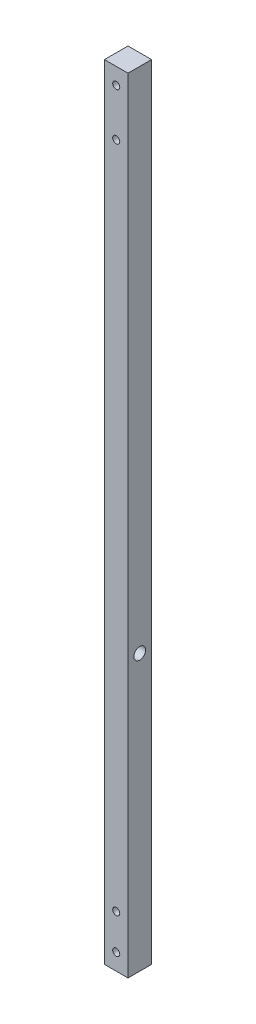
ISO-10303-21;
HEADER;
FILE_DESCRIPTION(('STEP AP214'),'2;1');
FILE_NAME('part.step','',(''),(''),'','','');
FILE_SCHEMA(('AUTOMOTIVE_DESIGN { 1 0 10303 214 1 1 1 1 }'));
ENDSEC;
DATA;
#1=APPLICATION_CONTEXT('core data for automotive mechanical design processes');
#2=APPLICATION_PROTOCOL_DEFINITION('international standard','automotive_design',2000,#1);
#3=PRODUCT_CONTEXT('',#1,'mechanical');
#4=PRODUCT('Part','Part','',(#3));
#5=PRODUCT_RELATED_PRODUCT_CATEGORY('part','',(#4));
#6=PRODUCT_DEFINITION_FORMATION('','',#4);
#7=PRODUCT_DEFINITION_CONTEXT('part definition',#1,'design');
#8=PRODUCT_DEFINITION('design','',#6,#7);
#9=PRODUCT_DEFINITION_SHAPE('','',#8);
#10=(LENGTH_UNIT() NAMED_UNIT(*) SI_UNIT(.MILLI.,.METRE.));
#11=(NAMED_UNIT(*) PLANE_ANGLE_UNIT() SI_UNIT($,.RADIAN.));
#12=(NAMED_UNIT(*) SI_UNIT($,.STERADIAN.) SOLID_ANGLE_UNIT());
#13=UNCERTAINTY_MEASURE_WITH_UNIT(LENGTH_MEASURE(1.E-05),#10,'distance_accuracy_value','');
#14=(GEOMETRIC_REPRESENTATION_CONTEXT(3) GLOBAL_UNCERTAINTY_ASSIGNED_CONTEXT((#13)) GLOBAL_UNIT_ASSIGNED_CONTEXT((#10,
#11,#12)) REPRESENTATION_CONTEXT('',''));
#15=CARTESIAN_POINT('',(0.,0.,0.));
#16=DIRECTION('',(0.,0.,1.));
#17=DIRECTION('',(1.,0.,0.));
#18=AXIS2_PLACEMENT_3D('',#15,#16,#17);
#19=CARTESIAN_POINT('',(0.,333.,0.));
#20=DIRECTION('',(1.,0.,0.));
#21=DIRECTION('',(0.,0.,-1.));
#22=AXIS2_PLACEMENT_3D('',#19,#20,#21);
#23=PLANE('',#22);
#24=CARTESIAN_POINT('',(0.,117.,-5.));
#25=DIRECTION('',(1.,0.,0.));
#26=DIRECTION('',(0.,0.,-1.));
#27=AXIS2_PLACEMENT_3D('',#24,#25,#26);
#28=CIRCLE('',#27,2.5);
#29=CARTESIAN_POINT('',(0.,117.,-7.5));
#30=VERTEX_POINT('',#29);
#31=EDGE_CURVE('E128',#30,#30,#28,.T.);
#32=ORIENTED_EDGE('',*,*,#31,.T.);
#33=EDGE_LOOP('',(#32));
#34=FACE_BOUND('',#33,.T.);
#35=DIRECTION('',(0.,0.,1.));
#36=VECTOR('',#35,1.);
#37=CARTESIAN_POINT('',(0.,0.,0.));
#38=LINE('',#37,#36);
#39=CARTESIAN_POINT('',(0.,0.,-10.));
#40=VERTEX_POINT('',#39);
#41=CARTESIAN_POINT('',(0.,0.,0.));
#42=VERTEX_POINT('',#41);
#43=EDGE_CURVE('E74',#40,#42,#38,.T.);
#44=ORIENTED_EDGE('',*,*,#43,.T.);
#45=DIRECTION('',(0.,-1.,0.));
#46=VECTOR('',#45,1.);
#47=CARTESIAN_POINT('',(0.,333.,0.));
#48=LINE('',#47,#46);
#49=CARTESIAN_POINT('',(0.,333.,0.));
#50=VERTEX_POINT('',#49);
#51=EDGE_CURVE('E11',#50,#42,#48,.T.);
#52=ORIENTED_EDGE('',*,*,#51,.F.);
#53=DIRECTION('',(0.,0.,1.));
#54=VECTOR('',#53,1.);
#55=CARTESIAN_POINT('',(0.,333.,0.));
#56=LINE('',#55,#54);
#57=CARTESIAN_POINT('',(0.,333.,-10.));
#58=VERTEX_POINT('',#57);
#59=EDGE_CURVE('E97',#58,#50,#56,.T.);
#60=ORIENTED_EDGE('',*,*,#59,.F.);
#61=DIRECTION('',(0.,-1.,0.));
#62=VECTOR('',#61,1.);
#63=CARTESIAN_POINT('',(0.,333.,-10.));
#64=LINE('',#63,#62);
#65=EDGE_CURVE('E86',#58,#40,#64,.T.);
#66=ORIENTED_EDGE('',*,*,#65,.T.);
#67=EDGE_LOOP('',(#44,#52,#60,#66));
#68=FACE_BOUND('',#67,.T.);
#69=ADVANCED_FACE('F30',(#34,#68),#23,.F.);
#70=CARTESIAN_POINT('',(0.,333.,0.));
#71=DIRECTION('',(0.,0.,-1.));
#72=DIRECTION('',(-1.,0.,0.));
#73=AXIS2_PLACEMENT_3D('',#70,#71,#72);
#74=PLANE('',#73);
#75=CARTESIAN_POINT('',(5.,306.,0.));
#76=DIRECTION('',(0.,0.,1.));
#77=DIRECTION('',(1.,0.,0.));
#78=AXIS2_PLACEMENT_3D('',#75,#76,#77);
#79=CIRCLE('',#78,1.5);
#80=CARTESIAN_POINT('',(6.5,306.,0.));
#81=VERTEX_POINT('',#80);
#82=EDGE_CURVE('E130',#81,#81,#79,.T.);
#83=ORIENTED_EDGE('',*,*,#82,.F.);
#84=EDGE_LOOP('',(#83));
#85=FACE_BOUND('',#84,.T.);
#86=CARTESIAN_POINT('',(5.,326.,0.));
#87=DIRECTION('',(0.,0.,1.));
#88=DIRECTION('',(1.,0.,0.));
#89=AXIS2_PLACEMENT_3D('',#86,#87,#88);
#90=CIRCLE('',#89,1.5);
#91=CARTESIAN_POINT('',(6.5,326.,0.));
#92=VERTEX_POINT('',#91);
#93=EDGE_CURVE('E141',#92,#92,#90,.T.);
#94=ORIENTED_EDGE('',*,*,#93,.F.);
#95=EDGE_LOOP('',(#94));
#96=FACE_BOUND('',#95,.T.);
#97=CARTESIAN_POINT('',(5.,7.,0.));
#98=DIRECTION('',(0.,0.,1.));
#99=DIRECTION('',(1.,0.,0.));
#100=AXIS2_PLACEMENT_3D('',#97,#98,#99);
#101=CIRCLE('',#100,1.5);
#102=CARTESIAN_POINT('',(6.5,7.,0.));
#103=VERTEX_POINT('',#102);
#104=EDGE_CURVE('E147',#103,#103,#101,.T.);
#105=ORIENTED_EDGE('',*,*,#104,.F.);
#106=EDGE_LOOP('',(#105));
#107=FACE_BOUND('',#106,.T.);
#108=CARTESIAN_POINT('',(5.,22.,0.));
#109=DIRECTION('',(0.,0.,1.));
#110=DIRECTION('',(1.,0.,0.));
#111=AXIS2_PLACEMENT_3D('',#108,#109,#110);
#112=CIRCLE('',#111,1.5);
#113=CARTESIAN_POINT('',(6.5,22.,0.));
#114=VERTEX_POINT('',#113);
#115=EDGE_CURVE('E90',#114,#114,#112,.T.);
#116=ORIENTED_EDGE('',*,*,#115,.F.);
#117=EDGE_LOOP('',(#116));
#118=FACE_BOUND('',#117,.T.);
#119=DIRECTION('',(1.,0.,0.));
#120=VECTOR('',#119,1.);
#121=CARTESIAN_POINT('',(0.,0.,0.));
#122=LINE('',#121,#120);
#123=CARTESIAN_POINT('',(10.,0.,0.));
#124=VERTEX_POINT('',#123);
#125=EDGE_CURVE('E70',#42,#124,#122,.T.);
#126=ORIENTED_EDGE('',*,*,#125,.T.);
#127=DIRECTION('',(0.,-1.,0.));
#128=VECTOR('',#127,1.);
#129=CARTESIAN_POINT('',(10.,333.,0.));
#130=LINE('',#129,#128);
#131=CARTESIAN_POINT('',(10.,333.,0.));
#132=VERTEX_POINT('',#131);
#133=EDGE_CURVE('E37',#132,#124,#130,.T.);
#134=ORIENTED_EDGE('',*,*,#133,.F.);
#135=DIRECTION('',(1.,0.,0.));
#136=VECTOR('',#135,1.);
#137=CARTESIAN_POINT('',(0.,333.,0.));
#138=LINE('',#137,#136);
#139=EDGE_CURVE('E82',#50,#132,#138,.T.);
#140=ORIENTED_EDGE('',*,*,#139,.F.);
#141=ORIENTED_EDGE('',*,*,#51,.T.);
#142=EDGE_LOOP('',(#126,#134,#140,#141));
#143=FACE_BOUND('',#142,.T.);
#144=ADVANCED_FACE('F81',(#85,#96,#107,#118,#143),#74,.F.);
#145=CARTESIAN_POINT('',(10.,333.,0.));
#146=DIRECTION('',(-1.,0.,0.));
#147=DIRECTION('',(0.,0.,1.));
#148=AXIS2_PLACEMENT_3D('',#145,#146,#147);
#149=PLANE('',#148);
#150=CARTESIAN_POINT('',(10.,117.,-5.));
#151=DIRECTION('',(1.,0.,0.));
#152=DIRECTION('',(0.,0.,-1.));
#153=AXIS2_PLACEMENT_3D('',#150,#151,#152);
#154=CIRCLE('',#153,2.5);
#155=CARTESIAN_POINT('',(10.,117.,-7.5));
#156=VERTEX_POINT('',#155);
#157=EDGE_CURVE('E131',#156,#156,#154,.T.);
#158=ORIENTED_EDGE('',*,*,#157,.F.);
#159=EDGE_LOOP('',(#158));
#160=FACE_BOUND('',#159,.T.);
#161=DIRECTION('',(0.,0.,-1.));
#162=VECTOR('',#161,1.);
#163=CARTESIAN_POINT('',(10.,0.,0.));
#164=LINE('',#163,#162);
#165=CARTESIAN_POINT('',(10.,0.,-10.));
#166=VERTEX_POINT('',#165);
#167=EDGE_CURVE('E75',#124,#166,#164,.T.);
#168=ORIENTED_EDGE('',*,*,#167,.T.);
#169=DIRECTION('',(0.,-1.,0.));
#170=VECTOR('',#169,1.);
#171=CARTESIAN_POINT('',(10.,333.,-10.));
#172=LINE('',#171,#170);
#173=CARTESIAN_POINT('',(10.,333.,-10.));
#174=VERTEX_POINT('',#173);
#175=EDGE_CURVE('E103',#174,#166,#172,.T.);
#176=ORIENTED_EDGE('',*,*,#175,.F.);
#177=DIRECTION('',(0.,0.,-1.));
#178=VECTOR('',#177,1.);
#179=CARTESIAN_POINT('',(10.,333.,0.));
#180=LINE('',#179,#178);
#181=EDGE_CURVE('E49',#132,#174,#180,.T.);
#182=ORIENTED_EDGE('',*,*,#181,.F.);
#183=ORIENTED_EDGE('',*,*,#133,.T.);
#184=EDGE_LOOP('',(#168,#176,#182,#183));
#185=FACE_BOUND('',#184,.T.);
#186=ADVANCED_FACE('F106',(#160,#185),#149,.F.);
#187=CARTESIAN_POINT('',(0.,333.,-10.));
#188=DIRECTION('',(0.,0.,1.));
#189=DIRECTION('',(1.,0.,0.));
#190=AXIS2_PLACEMENT_3D('',#187,#188,#189);
#191=PLANE('',#190);
#192=CARTESIAN_POINT('',(5.,306.,-10.));
#193=DIRECTION('',(0.,0.,1.));
#194=DIRECTION('',(1.,0.,0.));
#195=AXIS2_PLACEMENT_3D('',#192,#193,#194);
#196=CIRCLE('',#195,1.5);
#197=CARTESIAN_POINT('',(6.5,306.,-10.));
#198=VERTEX_POINT('',#197);
#199=EDGE_CURVE('E134',#198,#198,#196,.T.);
#200=ORIENTED_EDGE('',*,*,#199,.T.);
#201=EDGE_LOOP('',(#200));
#202=FACE_BOUND('',#201,.T.);
#203=CARTESIAN_POINT('',(5.,326.,-10.));
#204=DIRECTION('',(0.,0.,1.));
#205=DIRECTION('',(1.,0.,0.));
#206=AXIS2_PLACEMENT_3D('',#203,#204,#205);
#207=CIRCLE('',#206,1.5);
#208=CARTESIAN_POINT('',(6.5,326.,-10.));
#209=VERTEX_POINT('',#208);
#210=EDGE_CURVE('E144',#209,#209,#207,.T.);
#211=ORIENTED_EDGE('',*,*,#210,.T.);
#212=EDGE_LOOP('',(#211));
#213=FACE_BOUND('',#212,.T.);
#214=CARTESIAN_POINT('',(5.,7.,-10.));
#215=DIRECTION('',(0.,0.,1.));
#216=DIRECTION('',(1.,0.,0.));
#217=AXIS2_PLACEMENT_3D('',#214,#215,#216);
#218=CIRCLE('',#217,1.5);
#219=CARTESIAN_POINT('',(6.5,7.,-10.));
#220=VERTEX_POINT('',#219);
#221=EDGE_CURVE('E150',#220,#220,#218,.T.);
#222=ORIENTED_EDGE('',*,*,#221,.T.);
#223=EDGE_LOOP('',(#222));
#224=FACE_BOUND('',#223,.T.);
#225=CARTESIAN_POINT('',(5.,22.,-10.));
#226=DIRECTION('',(0.,0.,1.));
#227=DIRECTION('',(1.,0.,0.));
#228=AXIS2_PLACEMENT_3D('',#225,#226,#227);
#229=CIRCLE('',#228,1.5);
#230=CARTESIAN_POINT('',(6.5,22.,-10.));
#231=VERTEX_POINT('',#230);
#232=EDGE_CURVE('E87',#231,#231,#229,.T.);
#233=ORIENTED_EDGE('',*,*,#232,.T.);
#234=EDGE_LOOP('',(#233));
#235=FACE_BOUND('',#234,.T.);
#236=DIRECTION('',(-1.,0.,0.));
#237=VECTOR('',#236,1.);
#238=CARTESIAN_POINT('',(0.,0.,-10.));
#239=LINE('',#238,#237);
#240=EDGE_CURVE('E95',#166,#40,#239,.T.);
#241=ORIENTED_EDGE('',*,*,#240,.T.);
#242=ORIENTED_EDGE('',*,*,#65,.F.);
#243=DIRECTION('',(-1.,0.,0.));
#244=VECTOR('',#243,1.);
#245=CARTESIAN_POINT('',(0.,333.,-10.));
#246=LINE('',#245,#244);
#247=EDGE_CURVE('E44',#174,#58,#246,.T.);
#248=ORIENTED_EDGE('',*,*,#247,.F.);
#249=ORIENTED_EDGE('',*,*,#175,.T.);
#250=EDGE_LOOP('',(#241,#242,#248,#249));
#251=FACE_BOUND('',#250,.T.);
#252=ADVANCED_FACE('F108',(#202,#213,#224,#235,#251),#191,.F.);
#253=CARTESIAN_POINT('',(0.,333.,-10.));
#254=DIRECTION('',(0.,-1.,0.));
#255=DIRECTION('',(0.,0.,-1.));
#256=AXIS2_PLACEMENT_3D('',#253,#254,#255);
#257=PLANE('',#256);
#258=ORIENTED_EDGE('',*,*,#59,.T.);
#259=ORIENTED_EDGE('',*,*,#139,.T.);
#260=ORIENTED_EDGE('',*,*,#181,.T.);
#261=ORIENTED_EDGE('',*,*,#247,.T.);
#262=EDGE_LOOP('',(#258,#259,#260,#261));
#263=FACE_BOUND('',#262,.T.);
#264=ADVANCED_FACE('F109',(#263),#257,.F.);
#265=CARTESIAN_POINT('',(0.,0.,-10.));
#266=DIRECTION('',(0.,-1.,0.));
#267=DIRECTION('',(0.,0.,-1.));
#268=AXIS2_PLACEMENT_3D('',#265,#266,#267);
#269=PLANE('',#268);
#270=ORIENTED_EDGE('',*,*,#43,.F.);
#271=ORIENTED_EDGE('',*,*,#240,.F.);
#272=ORIENTED_EDGE('',*,*,#167,.F.);
#273=ORIENTED_EDGE('',*,*,#125,.F.);
#274=EDGE_LOOP('',(#270,#271,#272,#273));
#275=FACE_BOUND('',#274,.T.);
#276=ADVANCED_FACE('F71',(#275),#269,.T.);
#277=CARTESIAN_POINT('',(5.,22.,-10.));
#278=DIRECTION('',(0.,0.,1.));
#279=DIRECTION('',(1.,0.,0.));
#280=AXIS2_PLACEMENT_3D('',#277,#278,#279);
#281=CYLINDRICAL_SURFACE('',#280,1.5);
#282=ORIENTED_EDGE('',*,*,#232,.F.);
#283=EDGE_LOOP('',(#282));
#284=FACE_BOUND('',#283,.T.);
#285=ORIENTED_EDGE('',*,*,#115,.T.);
#286=EDGE_LOOP('',(#285));
#287=FACE_BOUND('',#286,.T.);
#288=ADVANCED_FACE('F116',(#284,#287),#281,.F.);
#289=CARTESIAN_POINT('',(5.,7.,-10.));
#290=DIRECTION('',(0.,0.,1.));
#291=DIRECTION('',(1.,0.,0.));
#292=AXIS2_PLACEMENT_3D('',#289,#290,#291);
#293=CYLINDRICAL_SURFACE('',#292,1.5);
#294=ORIENTED_EDGE('',*,*,#221,.F.);
#295=EDGE_LOOP('',(#294));
#296=FACE_BOUND('',#295,.T.);
#297=ORIENTED_EDGE('',*,*,#104,.T.);
#298=EDGE_LOOP('',(#297));
#299=FACE_BOUND('',#298,.T.);
#300=ADVANCED_FACE('F157',(#296,#299),#293,.F.);
#301=CARTESIAN_POINT('',(5.,326.,-10.));
#302=DIRECTION('',(0.,0.,1.));
#303=DIRECTION('',(1.,0.,0.));
#304=AXIS2_PLACEMENT_3D('',#301,#302,#303);
#305=CYLINDRICAL_SURFACE('',#304,1.5);
#306=ORIENTED_EDGE('',*,*,#210,.F.);
#307=EDGE_LOOP('',(#306));
#308=FACE_BOUND('',#307,.T.);
#309=ORIENTED_EDGE('',*,*,#93,.T.);
#310=EDGE_LOOP('',(#309));
#311=FACE_BOUND('',#310,.T.);
#312=ADVANCED_FACE('F163',(#308,#311),#305,.F.);
#313=CARTESIAN_POINT('',(5.,306.,-10.));
#314=DIRECTION('',(0.,0.,1.));
#315=DIRECTION('',(1.,0.,0.));
#316=AXIS2_PLACEMENT_3D('',#313,#314,#315);
#317=CYLINDRICAL_SURFACE('',#316,1.5);
#318=ORIENTED_EDGE('',*,*,#199,.F.);
#319=EDGE_LOOP('',(#318));
#320=FACE_BOUND('',#319,.T.);
#321=ORIENTED_EDGE('',*,*,#82,.T.);
#322=EDGE_LOOP('',(#321));
#323=FACE_BOUND('',#322,.T.);
#324=ADVANCED_FACE('F170',(#320,#323),#317,.F.);
#325=CARTESIAN_POINT('',(0.,117.,-5.));
#326=DIRECTION('',(1.,0.,0.));
#327=DIRECTION('',(0.,0.,-1.));
#328=AXIS2_PLACEMENT_3D('',#325,#326,#327);
#329=CYLINDRICAL_SURFACE('',#328,2.5);
#330=ORIENTED_EDGE('',*,*,#31,.F.);
#331=EDGE_LOOP('',(#330));
#332=FACE_BOUND('',#331,.T.);
#333=ORIENTED_EDGE('',*,*,#157,.T.);
#334=EDGE_LOOP('',(#333));
#335=FACE_BOUND('',#334,.T.);
#336=ADVANCED_FACE('F174',(#332,#335),#329,.F.);
#337=CLOSED_SHELL('',(#69,#144,#186,#252,#264,#276,#288,#300,#312,#324,#336));
#338=MANIFOLD_SOLID_BREP('B2',#337);
#339=ADVANCED_BREP_SHAPE_REPRESENTATION('',(#18,#338),#14);
#340=SHAPE_DEFINITION_REPRESENTATION(#9,#339);
ENDSEC;
END-ISO-10303-21;
